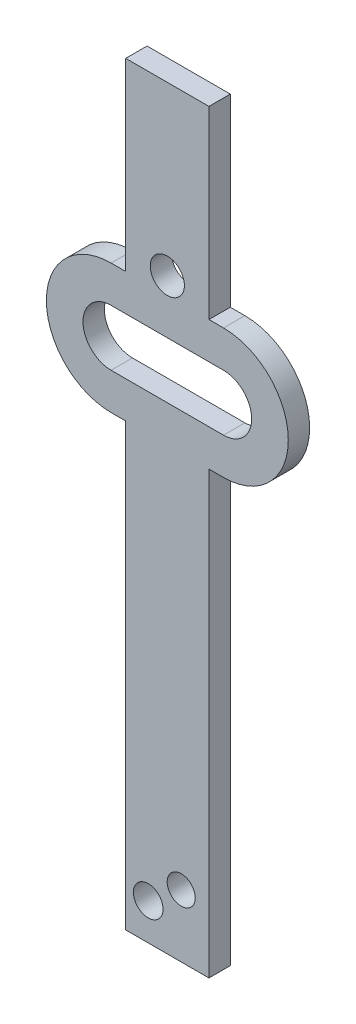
ISO-10303-21;
HEADER;
FILE_DESCRIPTION(('STEP AP214'),'2;1');
FILE_NAME('part.step','',(''),(''),'','','');
FILE_SCHEMA(('AUTOMOTIVE_DESIGN { 1 0 10303 214 1 1 1 1 }'));
ENDSEC;
DATA;
#1=APPLICATION_CONTEXT('core data for automotive mechanical design processes');
#2=APPLICATION_PROTOCOL_DEFINITION('international standard','automotive_design',2000,#1);
#3=PRODUCT_CONTEXT('',#1,'mechanical');
#4=PRODUCT('Part','Part','',(#3));
#5=PRODUCT_RELATED_PRODUCT_CATEGORY('part','',(#4));
#6=PRODUCT_DEFINITION_FORMATION('','',#4);
#7=PRODUCT_DEFINITION_CONTEXT('part definition',#1,'design');
#8=PRODUCT_DEFINITION('design','',#6,#7);
#9=PRODUCT_DEFINITION_SHAPE('','',#8);
#10=(LENGTH_UNIT() NAMED_UNIT(*) SI_UNIT(.MILLI.,.METRE.));
#11=(NAMED_UNIT(*) PLANE_ANGLE_UNIT() SI_UNIT($,.RADIAN.));
#12=(NAMED_UNIT(*) SI_UNIT($,.STERADIAN.) SOLID_ANGLE_UNIT());
#13=UNCERTAINTY_MEASURE_WITH_UNIT(LENGTH_MEASURE(1.E-05),#10,'distance_accuracy_value','');
#14=(GEOMETRIC_REPRESENTATION_CONTEXT(3) GLOBAL_UNCERTAINTY_ASSIGNED_CONTEXT((#13)) GLOBAL_UNIT_ASSIGNED_CONTEXT((#10,
#11,#12)) REPRESENTATION_CONTEXT('',''));
#15=CARTESIAN_POINT('',(0.,0.,0.));
#16=DIRECTION('',(0.,0.,1.));
#17=DIRECTION('',(1.,0.,0.));
#18=AXIS2_PLACEMENT_3D('',#15,#16,#17);
#19=CARTESIAN_POINT('',(7.9,18.0013504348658,3.));
#20=DIRECTION('',(0.,0.,-1.));
#21=DIRECTION('',(-1.,0.,0.));
#22=AXIS2_PLACEMENT_3D('',#19,#20,#21);
#23=CYLINDRICAL_SURFACE('',#22,3.95);
#24=CARTESIAN_POINT('',(7.9,18.0013504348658,0.));
#25=DIRECTION('',(0.,0.,1.));
#26=DIRECTION('',(1.,0.,0.));
#27=AXIS2_PLACEMENT_3D('',#24,#25,#26);
#28=CIRCLE('',#27,3.95);
#29=CARTESIAN_POINT('',(7.9,21.9513504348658,0.));
#30=VERTEX_POINT('',#29);
#31=CARTESIAN_POINT('',(7.9,14.0513504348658,0.));
#32=VERTEX_POINT('',#31);
#33=EDGE_CURVE('E244',#30,#32,#28,.F.);
#34=ORIENTED_EDGE('',*,*,#33,.T.);
#35=DIRECTION('',(0.,0.,-1.));
#36=VECTOR('',#35,1.);
#37=CARTESIAN_POINT('',(7.9,14.0513504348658,3.));
#38=LINE('',#37,#36);
#39=CARTESIAN_POINT('',(7.9,14.0513504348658,3.));
#40=VERTEX_POINT('',#39);
#41=EDGE_CURVE('E11',#40,#32,#38,.T.);
#42=ORIENTED_EDGE('',*,*,#41,.F.);
#43=CARTESIAN_POINT('',(7.9,18.0013504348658,3.));
#44=DIRECTION('',(0.,0.,1.));
#45=DIRECTION('',(1.,0.,0.));
#46=AXIS2_PLACEMENT_3D('',#43,#44,#45);
#47=CIRCLE('',#46,3.95);
#48=CARTESIAN_POINT('',(7.9,21.9513504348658,3.));
#49=VERTEX_POINT('',#48);
#50=EDGE_CURVE('E180',#49,#40,#47,.F.);
#51=ORIENTED_EDGE('',*,*,#50,.F.);
#52=DIRECTION('',(0.,0.,-1.));
#53=VECTOR('',#52,1.);
#54=CARTESIAN_POINT('',(7.9,21.9513504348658,3.));
#55=LINE('',#54,#53);
#56=EDGE_CURVE('E261',#49,#30,#55,.T.);
#57=ORIENTED_EDGE('',*,*,#56,.T.);
#58=EDGE_LOOP('',(#34,#42,#51,#57));
#59=FACE_BOUND('',#58,.T.);
#60=ADVANCED_FACE('F41',(#59),#23,.F.);
#61=CARTESIAN_POINT('',(0.,14.0513504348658,3.));
#62=DIRECTION('',(0.,-1.,0.));
#63=DIRECTION('',(1.,0.,0.));
#64=AXIS2_PLACEMENT_3D('',#61,#62,#63);
#65=PLANE('',#64);
#66=DIRECTION('',(-1.,0.,0.));
#67=VECTOR('',#66,1.);
#68=CARTESIAN_POINT('',(0.,14.0513504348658,0.));
#69=LINE('',#68,#67);
#70=CARTESIAN_POINT('',(-7.9,14.0513504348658,0.));
#71=VERTEX_POINT('',#70);
#72=EDGE_CURVE('E186',#32,#71,#69,.T.);
#73=ORIENTED_EDGE('',*,*,#72,.T.);
#74=DIRECTION('',(0.,0.,-1.));
#75=VECTOR('',#74,1.);
#76=CARTESIAN_POINT('',(-7.9,14.0513504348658,3.));
#77=LINE('',#76,#75);
#78=CARTESIAN_POINT('',(-7.9,14.0513504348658,3.));
#79=VERTEX_POINT('',#78);
#80=EDGE_CURVE('E50',#79,#71,#77,.T.);
#81=ORIENTED_EDGE('',*,*,#80,.F.);
#82=DIRECTION('',(-1.,0.,0.));
#83=VECTOR('',#82,1.);
#84=CARTESIAN_POINT('',(0.,14.0513504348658,3.));
#85=LINE('',#84,#83);
#86=EDGE_CURVE('E173',#40,#79,#85,.T.);
#87=ORIENTED_EDGE('',*,*,#86,.F.);
#88=ORIENTED_EDGE('',*,*,#41,.T.);
#89=EDGE_LOOP('',(#73,#81,#87,#88));
#90=FACE_BOUND('',#89,.T.);
#91=ADVANCED_FACE('F185',(#90),#65,.F.);
#92=CARTESIAN_POINT('',(-7.9,18.0013504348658,3.));
#93=DIRECTION('',(0.,0.,-1.));
#94=DIRECTION('',(-1.,0.,0.));
#95=AXIS2_PLACEMENT_3D('',#92,#93,#94);
#96=CYLINDRICAL_SURFACE('',#95,3.95);
#97=CARTESIAN_POINT('',(-7.9,18.0013504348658,0.));
#98=DIRECTION('',(0.,0.,1.));
#99=DIRECTION('',(1.,0.,0.));
#100=AXIS2_PLACEMENT_3D('',#97,#98,#99);
#101=CIRCLE('',#100,3.95);
#102=CARTESIAN_POINT('',(-7.9,21.9513504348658,0.));
#103=VERTEX_POINT('',#102);
#104=EDGE_CURVE('E248',#103,#71,#101,.T.);
#105=ORIENTED_EDGE('',*,*,#104,.F.);
#106=DIRECTION('',(0.,0.,-1.));
#107=VECTOR('',#106,1.);
#108=CARTESIAN_POINT('',(-7.9,21.9513504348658,3.));
#109=LINE('',#108,#107);
#110=CARTESIAN_POINT('',(-7.9,21.9513504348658,3.));
#111=VERTEX_POINT('',#110);
#112=EDGE_CURVE('E190',#111,#103,#109,.T.);
#113=ORIENTED_EDGE('',*,*,#112,.F.);
#114=CARTESIAN_POINT('',(-7.9,18.0013504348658,3.));
#115=DIRECTION('',(0.,0.,1.));
#116=DIRECTION('',(1.,0.,0.));
#117=AXIS2_PLACEMENT_3D('',#114,#115,#116);
#118=CIRCLE('',#117,3.95);
#119=EDGE_CURVE('E178',#111,#79,#118,.T.);
#120=ORIENTED_EDGE('',*,*,#119,.T.);
#121=ORIENTED_EDGE('',*,*,#80,.T.);
#122=EDGE_LOOP('',(#105,#113,#120,#121));
#123=FACE_BOUND('',#122,.T.);
#124=ADVANCED_FACE('F192',(#123),#96,.F.);
#125=CARTESIAN_POINT('',(5.85,0.,3.));
#126=DIRECTION('',(-1.,0.,0.));
#127=DIRECTION('',(0.,-1.,0.));
#128=AXIS2_PLACEMENT_3D('',#125,#126,#127);
#129=PLANE('',#128);
#130=DIRECTION('',(0.,1.,0.));
#131=VECTOR('',#130,1.);
#132=CARTESIAN_POINT('',(5.85,0.,0.));
#133=LINE('',#132,#131);
#134=CARTESIAN_POINT('',(5.85,-53.045,0.));
#135=VERTEX_POINT('',#134);
#136=CARTESIAN_POINT('',(5.85,8.90135043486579,0.));
#137=VERTEX_POINT('',#136);
#138=EDGE_CURVE('E207',#135,#137,#133,.T.);
#139=ORIENTED_EDGE('',*,*,#138,.T.);
#140=DIRECTION('',(0.,0.,-1.));
#141=VECTOR('',#140,1.);
#142=CARTESIAN_POINT('',(5.85,8.90135043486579,3.));
#143=LINE('',#142,#141);
#144=CARTESIAN_POINT('',(5.85,8.90135043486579,3.));
#145=VERTEX_POINT('',#144);
#146=EDGE_CURVE('E45',#145,#137,#143,.T.);
#147=ORIENTED_EDGE('',*,*,#146,.F.);
#148=DIRECTION('',(0.,1.,0.));
#149=VECTOR('',#148,1.);
#150=CARTESIAN_POINT('',(5.85,0.,3.));
#151=LINE('',#150,#149);
#152=CARTESIAN_POINT('',(5.85,-53.045,3.));
#153=VERTEX_POINT('',#152);
#154=EDGE_CURVE('E260',#153,#145,#151,.T.);
#155=ORIENTED_EDGE('',*,*,#154,.F.);
#156=DIRECTION('',(0.,0.,-1.));
#157=VECTOR('',#156,1.);
#158=CARTESIAN_POINT('',(5.85,-53.045,3.));
#159=LINE('',#158,#157);
#160=EDGE_CURVE('E206',#153,#135,#159,.T.);
#161=ORIENTED_EDGE('',*,*,#160,.T.);
#162=EDGE_LOOP('',(#139,#147,#155,#161));
#163=FACE_BOUND('',#162,.T.);
#164=ADVANCED_FACE('F43',(#163),#129,.F.);
#165=CARTESIAN_POINT('',(0.,8.90135043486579,3.));
#166=DIRECTION('',(0.,1.,0.));
#167=DIRECTION('',(-1.,0.,0.));
#168=AXIS2_PLACEMENT_3D('',#165,#166,#167);
#169=PLANE('',#168);
#170=DIRECTION('',(1.,0.,0.));
#171=VECTOR('',#170,1.);
#172=CARTESIAN_POINT('',(0.,8.90135043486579,0.));
#173=LINE('',#172,#171);
#174=CARTESIAN_POINT('',(7.9,8.90135043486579,0.));
#175=VERTEX_POINT('',#174);
#176=EDGE_CURVE('E210',#137,#175,#173,.T.);
#177=ORIENTED_EDGE('',*,*,#176,.T.);
#178=DIRECTION('',(0.,0.,-1.));
#179=VECTOR('',#178,1.);
#180=CARTESIAN_POINT('',(7.9,8.90135043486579,3.));
#181=LINE('',#180,#179);
#182=CARTESIAN_POINT('',(7.9,8.90135043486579,3.));
#183=VERTEX_POINT('',#182);
#184=EDGE_CURVE('E284',#183,#175,#181,.T.);
#185=ORIENTED_EDGE('',*,*,#184,.F.);
#186=DIRECTION('',(1.,0.,0.));
#187=VECTOR('',#186,1.);
#188=CARTESIAN_POINT('',(0.,8.90135043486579,3.));
#189=LINE('',#188,#187);
#190=EDGE_CURVE('E133',#145,#183,#189,.T.);
#191=ORIENTED_EDGE('',*,*,#190,.F.);
#192=ORIENTED_EDGE('',*,*,#146,.T.);
#193=EDGE_LOOP('',(#177,#185,#191,#192));
#194=FACE_BOUND('',#193,.T.);
#195=ADVANCED_FACE('F289',(#194),#169,.F.);
#196=CARTESIAN_POINT('',(7.9,18.0013504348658,3.));
#197=DIRECTION('',(0.,0.,-1.));
#198=DIRECTION('',(-1.,0.,0.));
#199=AXIS2_PLACEMENT_3D('',#196,#197,#198);
#200=CYLINDRICAL_SURFACE('',#199,9.1);
#201=CARTESIAN_POINT('',(7.9,18.0013504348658,0.));
#202=DIRECTION('',(0.,0.,1.));
#203=DIRECTION('',(1.,0.,0.));
#204=AXIS2_PLACEMENT_3D('',#201,#202,#203);
#205=CIRCLE('',#204,9.1);
#206=CARTESIAN_POINT('',(7.9,27.1013504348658,0.));
#207=VERTEX_POINT('',#206);
#208=EDGE_CURVE('E214',#207,#175,#205,.F.);
#209=ORIENTED_EDGE('',*,*,#208,.F.);
#210=DIRECTION('',(0.,0.,-1.));
#211=VECTOR('',#210,1.);
#212=CARTESIAN_POINT('',(7.9,27.1013504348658,3.));
#213=LINE('',#212,#211);
#214=CARTESIAN_POINT('',(7.9,27.1013504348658,3.));
#215=VERTEX_POINT('',#214);
#216=EDGE_CURVE('E283',#215,#207,#213,.T.);
#217=ORIENTED_EDGE('',*,*,#216,.F.);
#218=CARTESIAN_POINT('',(7.9,18.0013504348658,3.));
#219=DIRECTION('',(0.,0.,1.));
#220=DIRECTION('',(1.,0.,0.));
#221=AXIS2_PLACEMENT_3D('',#218,#219,#220);
#222=CIRCLE('',#221,9.1);
#223=EDGE_CURVE('E303',#215,#183,#222,.F.);
#224=ORIENTED_EDGE('',*,*,#223,.T.);
#225=ORIENTED_EDGE('',*,*,#184,.T.);
#226=EDGE_LOOP('',(#209,#217,#224,#225));
#227=FACE_BOUND('',#226,.T.);
#228=ADVANCED_FACE('F301',(#227),#200,.T.);
#229=CARTESIAN_POINT('',(0.,27.1013504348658,3.));
#230=DIRECTION('',(0.,1.,0.));
#231=DIRECTION('',(-1.,0.,0.));
#232=AXIS2_PLACEMENT_3D('',#229,#230,#231);
#233=PLANE('',#232);
#234=DIRECTION('',(1.,0.,0.));
#235=VECTOR('',#234,1.);
#236=CARTESIAN_POINT('',(0.,27.1013504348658,0.));
#237=LINE('',#236,#235);
#238=CARTESIAN_POINT('',(5.85,27.1013504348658,0.));
#239=VERTEX_POINT('',#238);
#240=EDGE_CURVE('E217',#239,#207,#237,.T.);
#241=ORIENTED_EDGE('',*,*,#240,.F.);
#242=DIRECTION('',(0.,0.,-1.));
#243=VECTOR('',#242,1.);
#244=CARTESIAN_POINT('',(5.85,27.1013504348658,3.));
#245=LINE('',#244,#243);
#246=CARTESIAN_POINT('',(5.85,27.1013504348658,3.));
#247=VERTEX_POINT('',#246);
#248=EDGE_CURVE('E281',#247,#239,#245,.T.);
#249=ORIENTED_EDGE('',*,*,#248,.F.);
#250=DIRECTION('',(1.,0.,0.));
#251=VECTOR('',#250,1.);
#252=CARTESIAN_POINT('',(0.,27.1013504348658,3.));
#253=LINE('',#252,#251);
#254=EDGE_CURVE('E308',#247,#215,#253,.T.);
#255=ORIENTED_EDGE('',*,*,#254,.T.);
#256=ORIENTED_EDGE('',*,*,#216,.T.);
#257=EDGE_LOOP('',(#241,#249,#255,#256));
#258=FACE_BOUND('',#257,.T.);
#259=ADVANCED_FACE('F310',(#258),#233,.T.);
#260=CARTESIAN_POINT('',(5.85,0.,3.));
#261=DIRECTION('',(-1.,0.,0.));
#262=DIRECTION('',(0.,0.,1.));
#263=AXIS2_PLACEMENT_3D('',#260,#261,#262);
#264=PLANE('',#263);
#265=DIRECTION('',(0.,1.,0.));
#266=VECTOR('',#265,1.);
#267=CARTESIAN_POINT('',(5.85,0.,0.));
#268=LINE('',#267,#266);
#269=CARTESIAN_POINT('',(5.85,53.045,0.));
#270=VERTEX_POINT('',#269);
#271=EDGE_CURVE('E220',#239,#270,#268,.T.);
#272=ORIENTED_EDGE('',*,*,#271,.T.);
#273=DIRECTION('',(0.,0.,-1.));
#274=VECTOR('',#273,1.);
#275=CARTESIAN_POINT('',(5.85,53.045,3.));
#276=LINE('',#275,#274);
#277=CARTESIAN_POINT('',(5.85,53.045,3.));
#278=VERTEX_POINT('',#277);
#279=EDGE_CURVE('E279',#278,#270,#276,.T.);
#280=ORIENTED_EDGE('',*,*,#279,.F.);
#281=DIRECTION('',(0.,1.,0.));
#282=VECTOR('',#281,1.);
#283=CARTESIAN_POINT('',(5.85,0.,3.));
#284=LINE('',#283,#282);
#285=EDGE_CURVE('E312',#247,#278,#284,.T.);
#286=ORIENTED_EDGE('',*,*,#285,.F.);
#287=ORIENTED_EDGE('',*,*,#248,.T.);
#288=EDGE_LOOP('',(#272,#280,#286,#287));
#289=FACE_BOUND('',#288,.T.);
#290=ADVANCED_FACE('F403',(#289),#264,.F.);
#291=CARTESIAN_POINT('',(0.,53.045,3.));
#292=DIRECTION('',(0.,1.,0.));
#293=DIRECTION('',(0.,0.,1.));
#294=AXIS2_PLACEMENT_3D('',#291,#292,#293);
#295=PLANE('',#294);
#296=DIRECTION('',(1.,0.,0.));
#297=VECTOR('',#296,1.);
#298=CARTESIAN_POINT('',(0.,53.045,0.));
#299=LINE('',#298,#297);
#300=CARTESIAN_POINT('',(-5.84999999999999,53.045,0.));
#301=VERTEX_POINT('',#300);
#302=EDGE_CURVE('E223',#301,#270,#299,.T.);
#303=ORIENTED_EDGE('',*,*,#302,.F.);
#304=DIRECTION('',(0.,0.,-1.));
#305=VECTOR('',#304,1.);
#306=CARTESIAN_POINT('',(-5.84999999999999,53.045,3.));
#307=LINE('',#306,#305);
#308=CARTESIAN_POINT('',(-5.84999999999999,53.045,3.));
#309=VERTEX_POINT('',#308);
#310=EDGE_CURVE('E277',#309,#301,#307,.T.);
#311=ORIENTED_EDGE('',*,*,#310,.F.);
#312=DIRECTION('',(1.,0.,0.));
#313=VECTOR('',#312,1.);
#314=CARTESIAN_POINT('',(0.,53.045,3.));
#315=LINE('',#314,#313);
#316=EDGE_CURVE('E314',#309,#278,#315,.T.);
#317=ORIENTED_EDGE('',*,*,#316,.T.);
#318=ORIENTED_EDGE('',*,*,#279,.T.);
#319=EDGE_LOOP('',(#303,#311,#317,#318));
#320=FACE_BOUND('',#319,.T.);
#321=ADVANCED_FACE('F399',(#320),#295,.T.);
#322=CARTESIAN_POINT('',(-5.84999999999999,0.,3.));
#323=DIRECTION('',(-1.,0.,0.));
#324=DIRECTION('',(0.,0.,1.));
#325=AXIS2_PLACEMENT_3D('',#322,#323,#324);
#326=PLANE('',#325);
#327=DIRECTION('',(0.,1.,0.));
#328=VECTOR('',#327,1.);
#329=CARTESIAN_POINT('',(-5.84999999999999,0.,0.));
#330=LINE('',#329,#328);
#331=CARTESIAN_POINT('',(-5.84999999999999,27.1013504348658,0.));
#332=VERTEX_POINT('',#331);
#333=EDGE_CURVE('E226',#332,#301,#330,.T.);
#334=ORIENTED_EDGE('',*,*,#333,.F.);
#335=DIRECTION('',(0.,0.,-1.));
#336=VECTOR('',#335,1.);
#337=CARTESIAN_POINT('',(-5.84999999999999,27.1013504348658,3.));
#338=LINE('',#337,#336);
#339=CARTESIAN_POINT('',(-5.84999999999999,27.1013504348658,3.));
#340=VERTEX_POINT('',#339);
#341=EDGE_CURVE('E275',#340,#332,#338,.T.);
#342=ORIENTED_EDGE('',*,*,#341,.F.);
#343=DIRECTION('',(0.,1.,0.));
#344=VECTOR('',#343,1.);
#345=CARTESIAN_POINT('',(-5.84999999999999,0.,3.));
#346=LINE('',#345,#344);
#347=EDGE_CURVE('E320',#340,#309,#346,.T.);
#348=ORIENTED_EDGE('',*,*,#347,.T.);
#349=ORIENTED_EDGE('',*,*,#310,.T.);
#350=EDGE_LOOP('',(#334,#342,#348,#349));
#351=FACE_BOUND('',#350,.T.);
#352=ADVANCED_FACE('F396',(#351),#326,.T.);
#353=CARTESIAN_POINT('',(0.,27.1013504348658,3.));
#354=DIRECTION('',(0.,1.,0.));
#355=DIRECTION('',(-1.,0.,0.));
#356=AXIS2_PLACEMENT_3D('',#353,#354,#355);
#357=PLANE('',#356);
#358=DIRECTION('',(1.,0.,0.));
#359=VECTOR('',#358,1.);
#360=CARTESIAN_POINT('',(0.,27.1013504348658,0.));
#361=LINE('',#360,#359);
#362=CARTESIAN_POINT('',(-7.9,27.1013504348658,0.));
#363=VERTEX_POINT('',#362);
#364=EDGE_CURVE('E229',#363,#332,#361,.T.);
#365=ORIENTED_EDGE('',*,*,#364,.F.);
#366=DIRECTION('',(0.,0.,-1.));
#367=VECTOR('',#366,1.);
#368=CARTESIAN_POINT('',(-7.9,27.1013504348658,3.));
#369=LINE('',#368,#367);
#370=CARTESIAN_POINT('',(-7.9,27.1013504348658,3.));
#371=VERTEX_POINT('',#370);
#372=EDGE_CURVE('E273',#371,#363,#369,.T.);
#373=ORIENTED_EDGE('',*,*,#372,.F.);
#374=DIRECTION('',(1.,0.,0.));
#375=VECTOR('',#374,1.);
#376=CARTESIAN_POINT('',(0.,27.1013504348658,3.));
#377=LINE('',#376,#375);
#378=EDGE_CURVE('E323',#371,#340,#377,.T.);
#379=ORIENTED_EDGE('',*,*,#378,.T.);
#380=ORIENTED_EDGE('',*,*,#341,.T.);
#381=EDGE_LOOP('',(#365,#373,#379,#380));
#382=FACE_BOUND('',#381,.T.);
#383=ADVANCED_FACE('F390',(#382),#357,.T.);
#384=CARTESIAN_POINT('',(-7.9,18.0013504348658,3.));
#385=DIRECTION('',(0.,0.,-1.));
#386=DIRECTION('',(-1.,0.,0.));
#387=AXIS2_PLACEMENT_3D('',#384,#385,#386);
#388=CYLINDRICAL_SURFACE('',#387,9.1);
#389=CARTESIAN_POINT('',(-7.9,18.0013504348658,0.));
#390=DIRECTION('',(0.,0.,1.));
#391=DIRECTION('',(1.,0.,0.));
#392=AXIS2_PLACEMENT_3D('',#389,#390,#391);
#393=CIRCLE('',#392,9.1);
#394=CARTESIAN_POINT('',(-7.9,8.90135043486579,0.));
#395=VERTEX_POINT('',#394);
#396=EDGE_CURVE('E232',#363,#395,#393,.T.);
#397=ORIENTED_EDGE('',*,*,#396,.T.);
#398=DIRECTION('',(0.,0.,-1.));
#399=VECTOR('',#398,1.);
#400=CARTESIAN_POINT('',(-7.9,8.90135043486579,3.));
#401=LINE('',#400,#399);
#402=CARTESIAN_POINT('',(-7.9,8.90135043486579,3.));
#403=VERTEX_POINT('',#402);
#404=EDGE_CURVE('E270',#403,#395,#401,.T.);
#405=ORIENTED_EDGE('',*,*,#404,.F.);
#406=CARTESIAN_POINT('',(-7.9,18.0013504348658,3.));
#407=DIRECTION('',(0.,0.,1.));
#408=DIRECTION('',(1.,0.,0.));
#409=AXIS2_PLACEMENT_3D('',#406,#407,#408);
#410=CIRCLE('',#409,9.1);
#411=EDGE_CURVE('E326',#371,#403,#410,.T.);
#412=ORIENTED_EDGE('',*,*,#411,.F.);
#413=ORIENTED_EDGE('',*,*,#372,.T.);
#414=EDGE_LOOP('',(#397,#405,#412,#413));
#415=FACE_BOUND('',#414,.T.);
#416=ADVANCED_FACE('F404',(#415),#388,.T.);
#417=CARTESIAN_POINT('',(0.,8.90135043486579,3.));
#418=DIRECTION('',(0.,1.,0.));
#419=DIRECTION('',(-1.,0.,0.));
#420=AXIS2_PLACEMENT_3D('',#417,#418,#419);
#421=PLANE('',#420);
#422=DIRECTION('',(1.,0.,0.));
#423=VECTOR('',#422,1.);
#424=CARTESIAN_POINT('',(0.,8.90135043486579,0.));
#425=LINE('',#424,#423);
#426=CARTESIAN_POINT('',(-5.84999999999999,8.90135043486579,0.));
#427=VERTEX_POINT('',#426);
#428=EDGE_CURVE('E234',#395,#427,#425,.T.);
#429=ORIENTED_EDGE('',*,*,#428,.T.);
#430=DIRECTION('',(0.,0.,-1.));
#431=VECTOR('',#430,1.);
#432=CARTESIAN_POINT('',(-5.84999999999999,8.90135043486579,3.));
#433=LINE('',#432,#431);
#434=CARTESIAN_POINT('',(-5.84999999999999,8.90135043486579,3.));
#435=VERTEX_POINT('',#434);
#436=EDGE_CURVE('E268',#435,#427,#433,.T.);
#437=ORIENTED_EDGE('',*,*,#436,.F.);
#438=DIRECTION('',(1.,0.,0.));
#439=VECTOR('',#438,1.);
#440=CARTESIAN_POINT('',(0.,8.90135043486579,3.));
#441=LINE('',#440,#439);
#442=EDGE_CURVE('E328',#403,#435,#441,.T.);
#443=ORIENTED_EDGE('',*,*,#442,.F.);
#444=ORIENTED_EDGE('',*,*,#404,.T.);
#445=EDGE_LOOP('',(#429,#437,#443,#444));
#446=FACE_BOUND('',#445,.T.);
#447=ADVANCED_FACE('F384',(#446),#421,.F.);
#448=CARTESIAN_POINT('',(-5.84999999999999,0.,3.));
#449=DIRECTION('',(-1.,0.,0.));
#450=DIRECTION('',(0.,0.,1.));
#451=AXIS2_PLACEMENT_3D('',#448,#449,#450);
#452=PLANE('',#451);
#453=DIRECTION('',(0.,1.,0.));
#454=VECTOR('',#453,1.);
#455=CARTESIAN_POINT('',(-5.84999999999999,0.,0.));
#456=LINE('',#455,#454);
#457=CARTESIAN_POINT('',(-5.84999999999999,-53.045,0.));
#458=VERTEX_POINT('',#457);
#459=EDGE_CURVE('E237',#458,#427,#456,.T.);
#460=ORIENTED_EDGE('',*,*,#459,.F.);
#461=DIRECTION('',(0.,0.,-1.));
#462=VECTOR('',#461,1.);
#463=CARTESIAN_POINT('',(-5.84999999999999,-53.045,3.));
#464=LINE('',#463,#462);
#465=CARTESIAN_POINT('',(-5.84999999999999,-53.045,3.));
#466=VERTEX_POINT('',#465);
#467=EDGE_CURVE('E266',#466,#458,#464,.T.);
#468=ORIENTED_EDGE('',*,*,#467,.F.);
#469=DIRECTION('',(0.,1.,0.));
#470=VECTOR('',#469,1.);
#471=CARTESIAN_POINT('',(-5.84999999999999,0.,3.));
#472=LINE('',#471,#470);
#473=EDGE_CURVE('E330',#466,#435,#472,.T.);
#474=ORIENTED_EDGE('',*,*,#473,.T.);
#475=ORIENTED_EDGE('',*,*,#436,.T.);
#476=EDGE_LOOP('',(#460,#468,#474,#475));
#477=FACE_BOUND('',#476,.T.);
#478=ADVANCED_FACE('F380',(#477),#452,.T.);
#479=CARTESIAN_POINT('',(-2.685,-47.91,3.));
#480=DIRECTION('',(0.,0.,-1.));
#481=DIRECTION('',(-1.,0.,0.));
#482=AXIS2_PLACEMENT_3D('',#479,#480,#481);
#483=CYLINDRICAL_SURFACE('',#482,2.085);
#484=CARTESIAN_POINT('',(-2.685,-47.91,3.));
#485=DIRECTION('',(0.,0.,1.));
#486=DIRECTION('',(1.,0.,0.));
#487=AXIS2_PLACEMENT_3D('',#484,#485,#486);
#488=CIRCLE('',#487,2.085);
#489=CARTESIAN_POINT('',(-0.599999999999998,-47.91,3.));
#490=VERTEX_POINT('',#489);
#491=EDGE_CURVE('E200',#490,#490,#488,.T.);
#492=ORIENTED_EDGE('',*,*,#491,.T.);
#493=EDGE_LOOP('',(#492));
#494=FACE_BOUND('',#493,.T.);
#495=CARTESIAN_POINT('',(-2.685,-47.91,0.));
#496=DIRECTION('',(0.,0.,1.));
#497=DIRECTION('',(1.,0.,0.));
#498=AXIS2_PLACEMENT_3D('',#495,#496,#497);
#499=CIRCLE('',#498,2.085);
#500=CARTESIAN_POINT('',(-0.599999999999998,-47.91,0.));
#501=VERTEX_POINT('',#500);
#502=EDGE_CURVE('E254',#501,#501,#499,.T.);
#503=ORIENTED_EDGE('',*,*,#502,.F.);
#504=EDGE_LOOP('',(#503));
#505=FACE_BOUND('',#504,.T.);
#506=ADVANCED_FACE('F427',(#494,#505),#483,.F.);
#507=CARTESIAN_POINT('',(0.,29.5013504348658,3.));
#508=DIRECTION('',(0.,0.,-1.));
#509=DIRECTION('',(-1.,0.,0.));
#510=AXIS2_PLACEMENT_3D('',#507,#508,#509);
#511=CYLINDRICAL_SURFACE('',#510,2.4);
#512=CARTESIAN_POINT('',(0.,29.5013504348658,3.));
#513=DIRECTION('',(0.,0.,1.));
#514=DIRECTION('',(1.,0.,0.));
#515=AXIS2_PLACEMENT_3D('',#512,#513,#514);
#516=CIRCLE('',#515,2.4);
#517=CARTESIAN_POINT('',(2.4,29.5013504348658,3.));
#518=VERTEX_POINT('',#517);
#519=EDGE_CURVE('E194',#518,#518,#516,.T.);
#520=ORIENTED_EDGE('',*,*,#519,.T.);
#521=EDGE_LOOP('',(#520));
#522=FACE_BOUND('',#521,.T.);
#523=CARTESIAN_POINT('',(0.,29.5013504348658,0.));
#524=DIRECTION('',(0.,0.,1.));
#525=DIRECTION('',(1.,0.,0.));
#526=AXIS2_PLACEMENT_3D('',#523,#524,#525);
#527=CIRCLE('',#526,2.4);
#528=CARTESIAN_POINT('',(2.4,29.5013504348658,0.));
#529=VERTEX_POINT('',#528);
#530=EDGE_CURVE('E251',#529,#529,#527,.T.);
#531=ORIENTED_EDGE('',*,*,#530,.F.);
#532=EDGE_LOOP('',(#531));
#533=FACE_BOUND('',#532,.T.);
#534=ADVANCED_FACE('F431',(#522,#533),#511,.F.);
#535=CARTESIAN_POINT('',(0.,21.9513504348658,3.));
#536=DIRECTION('',(0.,1.,0.));
#537=DIRECTION('',(-1.,0.,0.));
#538=AXIS2_PLACEMENT_3D('',#535,#536,#537);
#539=PLANE('',#538);
#540=DIRECTION('',(1.,0.,0.));
#541=VECTOR('',#540,1.);
#542=CARTESIAN_POINT('',(0.,21.9513504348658,0.));
#543=LINE('',#542,#541);
#544=EDGE_CURVE('E124',#103,#30,#543,.T.);
#545=ORIENTED_EDGE('',*,*,#544,.T.);
#546=ORIENTED_EDGE('',*,*,#56,.F.);
#547=DIRECTION('',(1.,0.,0.));
#548=VECTOR('',#547,1.);
#549=CARTESIAN_POINT('',(0.,21.9513504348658,3.));
#550=LINE('',#549,#548);
#551=EDGE_CURVE('E67',#111,#49,#550,.T.);
#552=ORIENTED_EDGE('',*,*,#551,.F.);
#553=ORIENTED_EDGE('',*,*,#112,.T.);
#554=EDGE_LOOP('',(#545,#546,#552,#553));
#555=FACE_BOUND('',#554,.T.);
#556=ADVANCED_FACE('F425',(#555),#539,.F.);
#557=CARTESIAN_POINT('',(0.,-53.045,3.));
#558=DIRECTION('',(0.,1.,0.));
#559=DIRECTION('',(0.,0.,1.));
#560=AXIS2_PLACEMENT_3D('',#557,#558,#559);
#561=PLANE('',#560);
#562=DIRECTION('',(-1.,0.,0.));
#563=VECTOR('',#562,1.);
#564=CARTESIAN_POINT('',(1.20445402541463,-53.045,0.49));
#565=LINE('',#564,#563);
#566=CARTESIAN_POINT('',(1.20445402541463,-53.045,0.49));
#567=VERTEX_POINT('',#566);
#568=CARTESIAN_POINT('',(-1.29554597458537,-53.045,0.49));
#569=VERTEX_POINT('',#568);
#570=EDGE_CURVE('E354',#567,#569,#565,.T.);
#571=ORIENTED_EDGE('',*,*,#570,.F.);
#572=DIRECTION('',(0.,0.,-1.));
#573=VECTOR('',#572,1.);
#574=CARTESIAN_POINT('',(1.20445402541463,-53.045,0.49));
#575=LINE('',#574,#573);
#576=CARTESIAN_POINT('',(1.20445402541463,-53.045,0.));
#577=VERTEX_POINT('',#576);
#578=EDGE_CURVE('E211',#567,#577,#575,.T.);
#579=ORIENTED_EDGE('',*,*,#578,.T.);
#580=DIRECTION('',(1.,0.,0.));
#581=VECTOR('',#580,1.);
#582=CARTESIAN_POINT('',(0.,-53.045,0.));
#583=LINE('',#582,#581);
#584=EDGE_CURVE('E240',#577,#135,#583,.T.);
#585=ORIENTED_EDGE('',*,*,#584,.T.);
#586=ORIENTED_EDGE('',*,*,#160,.F.);
#587=DIRECTION('',(1.,0.,0.));
#588=VECTOR('',#587,1.);
#589=CARTESIAN_POINT('',(0.,-53.045,3.));
#590=LINE('',#589,#588);
#591=EDGE_CURVE('E333',#466,#153,#590,.T.);
#592=ORIENTED_EDGE('',*,*,#591,.F.);
#593=ORIENTED_EDGE('',*,*,#467,.T.);
#594=CARTESIAN_POINT('',(-1.29554597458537,-53.045,0.));
#595=VERTEX_POINT('',#594);
#596=EDGE_CURVE('E241',#458,#595,#583,.T.);
#597=ORIENTED_EDGE('',*,*,#596,.T.);
#598=DIRECTION('',(0.,0.,-1.));
#599=VECTOR('',#598,1.);
#600=CARTESIAN_POINT('',(-1.29554597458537,-53.045,0.49));
#601=LINE('',#600,#599);
#602=EDGE_CURVE('E58',#569,#595,#601,.T.);
#603=ORIENTED_EDGE('',*,*,#602,.F.);
#604=EDGE_LOOP('',(#571,#579,#585,#586,#592,#593,#597,#603));
#605=FACE_BOUND('',#604,.T.);
#606=ADVANCED_FACE('F338',(#605),#561,.F.);
#607=CARTESIAN_POINT('',(1.95362048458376,-44.2713795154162,3.));
#608=DIRECTION('',(0.,0.,-1.));
#609=DIRECTION('',(-1.,0.,0.));
#610=AXIS2_PLACEMENT_3D('',#607,#608,#609);
#611=CYLINDRICAL_SURFACE('',#610,1.975);
#612=CARTESIAN_POINT('',(1.95362048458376,-44.2713795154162,3.));
#613=DIRECTION('',(0.,0.,1.));
#614=DIRECTION('',(1.,0.,0.));
#615=AXIS2_PLACEMENT_3D('',#612,#613,#614);
#616=CIRCLE('',#615,1.975);
#617=CARTESIAN_POINT('',(3.92862048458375,-44.2713795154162,3.));
#618=VERTEX_POINT('',#617);
#619=EDGE_CURVE('E203',#618,#618,#616,.T.);
#620=ORIENTED_EDGE('',*,*,#619,.T.);
#621=EDGE_LOOP('',(#620));
#622=FACE_BOUND('',#621,.T.);
#623=CARTESIAN_POINT('',(1.95362048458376,-44.2713795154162,0.));
#624=DIRECTION('',(0.,0.,1.));
#625=DIRECTION('',(1.,0.,0.));
#626=AXIS2_PLACEMENT_3D('',#623,#624,#625);
#627=CIRCLE('',#626,1.975);
#628=CARTESIAN_POINT('',(3.92862048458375,-44.2713795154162,0.));
#629=VERTEX_POINT('',#628);
#630=EDGE_CURVE('E257',#629,#629,#627,.T.);
#631=ORIENTED_EDGE('',*,*,#630,.F.);
#632=EDGE_LOOP('',(#631));
#633=FACE_BOUND('',#632,.T.);
#634=ADVANCED_FACE('F424',(#622,#633),#611,.F.);
#635=CARTESIAN_POINT('',(0.,0.,3.));
#636=DIRECTION('',(0.,0.,1.));
#637=DIRECTION('',(1.,0.,0.));
#638=AXIS2_PLACEMENT_3D('',#635,#636,#637);
#639=PLANE('',#638);
#640=ORIENTED_EDGE('',*,*,#154,.T.);
#641=ORIENTED_EDGE('',*,*,#190,.T.);
#642=ORIENTED_EDGE('',*,*,#223,.F.);
#643=ORIENTED_EDGE('',*,*,#254,.F.);
#644=ORIENTED_EDGE('',*,*,#285,.T.);
#645=ORIENTED_EDGE('',*,*,#316,.F.);
#646=ORIENTED_EDGE('',*,*,#347,.F.);
#647=ORIENTED_EDGE('',*,*,#378,.F.);
#648=ORIENTED_EDGE('',*,*,#411,.T.);
#649=ORIENTED_EDGE('',*,*,#442,.T.);
#650=ORIENTED_EDGE('',*,*,#473,.F.);
#651=ORIENTED_EDGE('',*,*,#591,.T.);
#652=EDGE_LOOP('',(#640,#641,#642,#643,#644,#645,#646,#647,#648,#649,#650,#651));
#653=FACE_BOUND('',#652,.T.);
#654=ORIENTED_EDGE('',*,*,#50,.T.);
#655=ORIENTED_EDGE('',*,*,#86,.T.);
#656=ORIENTED_EDGE('',*,*,#119,.F.);
#657=ORIENTED_EDGE('',*,*,#551,.T.);
#658=EDGE_LOOP('',(#654,#655,#656,#657));
#659=FACE_BOUND('',#658,.T.);
#660=ORIENTED_EDGE('',*,*,#519,.F.);
#661=EDGE_LOOP('',(#660));
#662=FACE_BOUND('',#661,.T.);
#663=ORIENTED_EDGE('',*,*,#491,.F.);
#664=EDGE_LOOP('',(#663));
#665=FACE_BOUND('',#664,.T.);
#666=ORIENTED_EDGE('',*,*,#619,.F.);
#667=EDGE_LOOP('',(#666));
#668=FACE_BOUND('',#667,.T.);
#669=ADVANCED_FACE('F175',(#653,#659,#662,#665,#668),#639,.T.);
#670=CARTESIAN_POINT('',(0.,0.,0.));
#671=DIRECTION('',(0.,0.,1.));
#672=DIRECTION('',(1.,0.,0.));
#673=AXIS2_PLACEMENT_3D('',#670,#671,#672);
#674=PLANE('',#673);
#675=ORIENTED_EDGE('',*,*,#584,.F.);
#676=DIRECTION('',(0.,-1.,0.));
#677=VECTOR('',#676,1.);
#678=CARTESIAN_POINT('',(1.20445402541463,-53.045,0.));
#679=LINE('',#678,#677);
#680=CARTESIAN_POINT('',(1.20445402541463,-50.995,0.));
#681=VERTEX_POINT('',#680);
#682=EDGE_CURVE('E351',#681,#577,#679,.T.);
#683=ORIENTED_EDGE('',*,*,#682,.F.);
#684=DIRECTION('',(1.,0.,0.));
#685=VECTOR('',#684,1.);
#686=CARTESIAN_POINT('',(1.20445402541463,-50.995,0.));
#687=LINE('',#686,#685);
#688=CARTESIAN_POINT('',(-1.29554597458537,-50.995,0.));
#689=VERTEX_POINT('',#688);
#690=EDGE_CURVE('E355',#689,#681,#687,.T.);
#691=ORIENTED_EDGE('',*,*,#690,.F.);
#692=DIRECTION('',(0.,1.,0.));
#693=VECTOR('',#692,1.);
#694=CARTESIAN_POINT('',(-1.29554597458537,-50.995,0.));
#695=LINE('',#694,#693);
#696=EDGE_CURVE('E358',#595,#689,#695,.T.);
#697=ORIENTED_EDGE('',*,*,#696,.F.);
#698=ORIENTED_EDGE('',*,*,#596,.F.);
#699=ORIENTED_EDGE('',*,*,#459,.T.);
#700=ORIENTED_EDGE('',*,*,#428,.F.);
#701=ORIENTED_EDGE('',*,*,#396,.F.);
#702=ORIENTED_EDGE('',*,*,#364,.T.);
#703=ORIENTED_EDGE('',*,*,#333,.T.);
#704=ORIENTED_EDGE('',*,*,#302,.T.);
#705=ORIENTED_EDGE('',*,*,#271,.F.);
#706=ORIENTED_EDGE('',*,*,#240,.T.);
#707=ORIENTED_EDGE('',*,*,#208,.T.);
#708=ORIENTED_EDGE('',*,*,#176,.F.);
#709=ORIENTED_EDGE('',*,*,#138,.F.);
#710=EDGE_LOOP('',(#675,#683,#691,#697,#698,#699,#700,#701,#702,#703,#704,#705,#706,#707,#708,#709));
#711=FACE_BOUND('',#710,.T.);
#712=ORIENTED_EDGE('',*,*,#33,.F.);
#713=ORIENTED_EDGE('',*,*,#544,.F.);
#714=ORIENTED_EDGE('',*,*,#104,.T.);
#715=ORIENTED_EDGE('',*,*,#72,.F.);
#716=EDGE_LOOP('',(#712,#713,#714,#715));
#717=FACE_BOUND('',#716,.T.);
#718=ORIENTED_EDGE('',*,*,#530,.T.);
#719=EDGE_LOOP('',(#718));
#720=FACE_BOUND('',#719,.T.);
#721=ORIENTED_EDGE('',*,*,#502,.T.);
#722=EDGE_LOOP('',(#721));
#723=FACE_BOUND('',#722,.T.);
#724=ORIENTED_EDGE('',*,*,#630,.T.);
#725=EDGE_LOOP('',(#724));
#726=FACE_BOUND('',#725,.T.);
#727=ADVANCED_FACE('F296',(#711,#717,#720,#723,#726),#674,.F.);
#728=CARTESIAN_POINT('',(1.20445402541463,-53.045,0.49));
#729=DIRECTION('',(1.,0.,0.));
#730=DIRECTION('',(0.,0.,-1.));
#731=AXIS2_PLACEMENT_3D('',#728,#729,#730);
#732=PLANE('',#731);
#733=ORIENTED_EDGE('',*,*,#682,.T.);
#734=ORIENTED_EDGE('',*,*,#578,.F.);
#735=DIRECTION('',(0.,-1.,0.));
#736=VECTOR('',#735,1.);
#737=CARTESIAN_POINT('',(1.20445402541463,-53.045,0.49));
#738=LINE('',#737,#736);
#739=CARTESIAN_POINT('',(1.20445402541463,-50.995,0.49));
#740=VERTEX_POINT('',#739);
#741=EDGE_CURVE('E344',#740,#567,#738,.T.);
#742=ORIENTED_EDGE('',*,*,#741,.F.);
#743=DIRECTION('',(0.,0.,-1.));
#744=VECTOR('',#743,1.);
#745=CARTESIAN_POINT('',(1.20445402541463,-50.995,0.49));
#746=LINE('',#745,#744);
#747=EDGE_CURVE('E347',#740,#681,#746,.T.);
#748=ORIENTED_EDGE('',*,*,#747,.T.);
#749=EDGE_LOOP('',(#733,#734,#742,#748));
#750=FACE_BOUND('',#749,.T.);
#751=ADVANCED_FACE('F558',(#750),#732,.F.);
#752=CARTESIAN_POINT('',(1.20445402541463,-50.995,0.49));
#753=DIRECTION('',(0.,1.,0.));
#754=DIRECTION('',(0.,0.,1.));
#755=AXIS2_PLACEMENT_3D('',#752,#753,#754);
#756=PLANE('',#755);
#757=ORIENTED_EDGE('',*,*,#690,.T.);
#758=ORIENTED_EDGE('',*,*,#747,.F.);
#759=DIRECTION('',(1.,0.,0.));
#760=VECTOR('',#759,1.);
#761=CARTESIAN_POINT('',(1.20445402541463,-50.995,0.49));
#762=LINE('',#761,#760);
#763=CARTESIAN_POINT('',(-1.29554597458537,-50.995,0.49));
#764=VERTEX_POINT('',#763);
#765=EDGE_CURVE('E362',#764,#740,#762,.T.);
#766=ORIENTED_EDGE('',*,*,#765,.F.);
#767=DIRECTION('',(0.,0.,-1.));
#768=VECTOR('',#767,1.);
#769=CARTESIAN_POINT('',(-1.29554597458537,-50.995,0.49));
#770=LINE('',#769,#768);
#771=EDGE_CURVE('E343',#764,#689,#770,.T.);
#772=ORIENTED_EDGE('',*,*,#771,.T.);
#773=EDGE_LOOP('',(#757,#758,#766,#772));
#774=FACE_BOUND('',#773,.T.);
#775=ADVANCED_FACE('F587',(#774),#756,.F.);
#776=CARTESIAN_POINT('',(-1.29554597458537,-50.995,0.49));
#777=DIRECTION('',(-1.,0.,0.));
#778=DIRECTION('',(0.,-1.,0.));
#779=AXIS2_PLACEMENT_3D('',#776,#777,#778);
#780=PLANE('',#779);
#781=ORIENTED_EDGE('',*,*,#696,.T.);
#782=ORIENTED_EDGE('',*,*,#771,.F.);
#783=DIRECTION('',(0.,1.,0.));
#784=VECTOR('',#783,1.);
#785=CARTESIAN_POINT('',(-1.29554597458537,-50.995,0.49));
#786=LINE('',#785,#784);
#787=EDGE_CURVE('E365',#569,#764,#786,.T.);
#788=ORIENTED_EDGE('',*,*,#787,.F.);
#789=ORIENTED_EDGE('',*,*,#602,.T.);
#790=EDGE_LOOP('',(#781,#782,#788,#789));
#791=FACE_BOUND('',#790,.T.);
#792=ADVANCED_FACE('F597',(#791),#780,.F.);
#793=CARTESIAN_POINT('',(0.,0.,0.49));
#794=DIRECTION('',(0.,0.,1.));
#795=DIRECTION('',(1.,0.,0.));
#796=AXIS2_PLACEMENT_3D('',#793,#794,#795);
#797=PLANE('',#796);
#798=ORIENTED_EDGE('',*,*,#570,.T.);
#799=ORIENTED_EDGE('',*,*,#787,.T.);
#800=ORIENTED_EDGE('',*,*,#765,.T.);
#801=ORIENTED_EDGE('',*,*,#741,.T.);
#802=EDGE_LOOP('',(#798,#799,#800,#801));
#803=FACE_BOUND('',#802,.T.);
#804=ADVANCED_FACE('F371',(#803),#797,.F.);
#805=CLOSED_SHELL('',(#60,#91,#124,#164,#195,#228,#259,#290,#321,#352,#383,#416,#447,#478,#506,
#534,#556,#606,#634,#669,#727,#751,#775,#792,#804));
#806=MANIFOLD_SOLID_BREP('B2',#805);
#807=ADVANCED_BREP_SHAPE_REPRESENTATION('',(#18,#806),#14);
#808=SHAPE_DEFINITION_REPRESENTATION(#9,#807);
ENDSEC;
END-ISO-10303-21;
